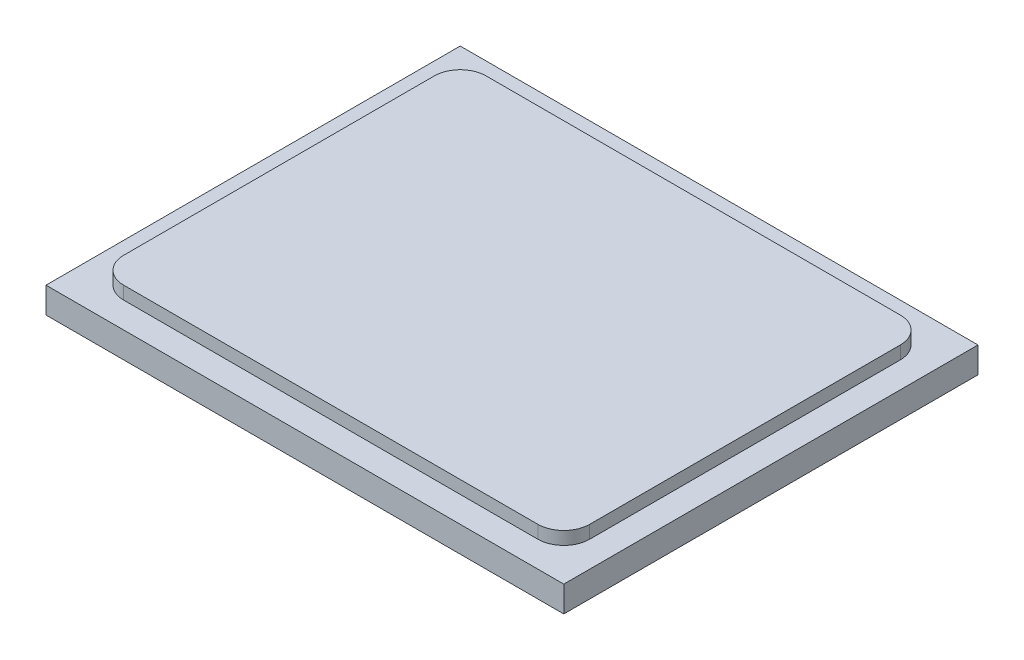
from build123d import *

# Parameters (mm, degrees)
SKETCH1_W           = 127
SKETCH1_H           = 101.6
BOSS_EXTRUDE1_DEPTH = 6.35
SKETCH2_W           = 114.3
SKETCH2_H           = 88.9
BOSS_EXTRUDE2_DEPTH = 3.175
CUT_EXTRUDE1_DEPTH  = 3.175


with BuildPart() as part:
    # Sketch1 → Boss-Extrude1 (new body)
    with BuildSketch(Plane(origin=(0, 0, 0), x_dir=(1, 0, 0), z_dir=(0, 1, 0))):
        with Locations((16.279117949, -21.936899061)):
            Rectangle(SKETCH1_W, SKETCH1_H)
    extrude(amount=BOSS_EXTRUDE1_DEPTH)

    # Sketch2 → Boss-Extrude2 (add)
    with BuildSketch(Plane(origin=(0, 6.35, 0), x_dir=(1, 0, 0), z_dir=(0, 1, 0))):
        with Locations((16.279117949, -21.936899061)):
            Rectangle(SKETCH2_W, SKETCH2_H)
    extrude(amount=BOSS_EXTRUDE2_DEPTH)

    # Sketch3 → Cut-Extrude1 (cut)
    with BuildSketch(Plane(origin=(0, 9.525, 0), x_dir=(1, 0, 0), z_dir=(0, 1, 0))):
        with BuildLine():
            Line((73.429117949, -66.386899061), (73.429117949, -60.036899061))
            ThreePointArc((73.429117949, -60.036899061), (71.56924601, -64.527027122), (67.079117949, -66.386899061))
            Line((67.079117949, -66.386899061), (73.429117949, -66.386899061))
        make_face()
        with BuildLine():
            ThreePointArc((67.079117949, 22.513100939), (71.56924601, 20.653228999), (73.429117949, 16.163100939))
            Line((73.429117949, 16.163100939), (73.429117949, 22.513100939))
            Line((73.429117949, 22.513100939), (67.079117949, 22.513100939))
        make_face()
        with BuildLine():
            ThreePointArc((-40.870882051, 16.163100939), (-39.011010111, 20.653228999), (-34.520882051, 22.513100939))
            Line((-34.520882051, 22.513100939), (-40.870882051, 22.513100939))
            Line((-40.870882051, 22.513100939), (-40.870882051, 16.163100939))
        make_face()
        with BuildLine():
            Line((-40.870882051, -66.386899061), (-34.520882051, -66.386899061))
            ThreePointArc((-34.520882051, -66.386899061), (-39.011010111, -64.527027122), (-40.870882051, -60.036899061))
            Line((-40.870882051, -60.036899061), (-40.870882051, -66.386899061))
        make_face()
    extrude(amount=-CUT_EXTRUDE1_DEPTH, mode=Mode.SUBTRACT)


solid = part.part
